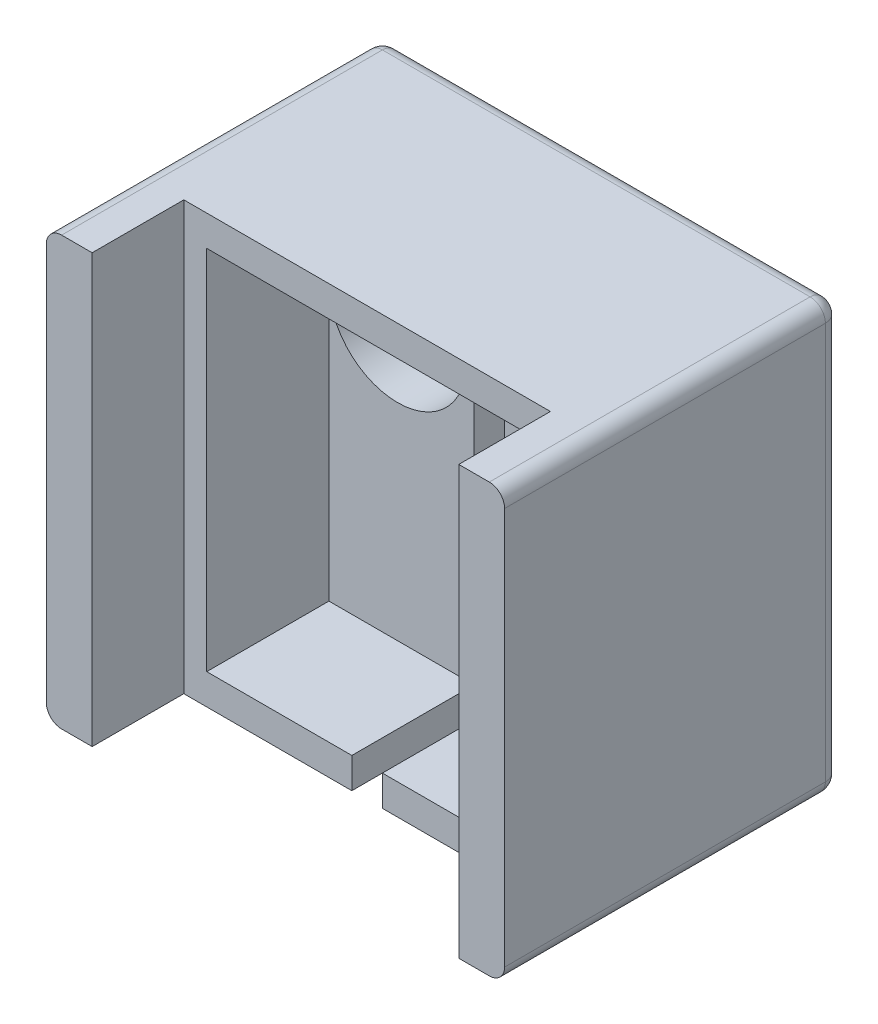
ISO-10303-21;
HEADER;
FILE_DESCRIPTION(('STEP AP214'),'2;1');
FILE_NAME('part.step','',(''),(''),'','','');
FILE_SCHEMA(('AUTOMOTIVE_DESIGN { 1 0 10303 214 1 1 1 1 }'));
ENDSEC;
DATA;
#1=APPLICATION_CONTEXT('core data for automotive mechanical design processes');
#2=APPLICATION_PROTOCOL_DEFINITION('international standard','automotive_design',2000,#1);
#3=PRODUCT_CONTEXT('',#1,'mechanical');
#4=PRODUCT('Part','Part','',(#3));
#5=PRODUCT_RELATED_PRODUCT_CATEGORY('part','',(#4));
#6=PRODUCT_DEFINITION_FORMATION('','',#4);
#7=PRODUCT_DEFINITION_CONTEXT('part definition',#1,'design');
#8=PRODUCT_DEFINITION('design','',#6,#7);
#9=PRODUCT_DEFINITION_SHAPE('','',#8);
#10=(LENGTH_UNIT() NAMED_UNIT(*) SI_UNIT(.MILLI.,.METRE.));
#11=(NAMED_UNIT(*) PLANE_ANGLE_UNIT() SI_UNIT($,.RADIAN.));
#12=(NAMED_UNIT(*) SI_UNIT($,.STERADIAN.) SOLID_ANGLE_UNIT());
#13=UNCERTAINTY_MEASURE_WITH_UNIT(LENGTH_MEASURE(1.E-05),#10,'distance_accuracy_value','');
#14=(GEOMETRIC_REPRESENTATION_CONTEXT(3) GLOBAL_UNCERTAINTY_ASSIGNED_CONTEXT((#13)) GLOBAL_UNIT_ASSIGNED_CONTEXT((#10,
#11,#12)) REPRESENTATION_CONTEXT('',''));
#15=CARTESIAN_POINT('',(0.,0.,0.));
#16=DIRECTION('',(0.,0.,1.));
#17=DIRECTION('',(1.,0.,0.));
#18=AXIS2_PLACEMENT_3D('',#15,#16,#17);
#19=CARTESIAN_POINT('',(2.25,0.999999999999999,4.));
#20=DIRECTION('',(0.,-1.,0.));
#21=DIRECTION('',(0.,0.,-1.));
#22=AXIS2_PLACEMENT_3D('',#19,#20,#21);
#23=PLANE('',#22);
#24=DIRECTION('',(1.,0.,0.));
#25=VECTOR('',#24,1.);
#26=CARTESIAN_POINT('',(2.25,0.999999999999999,8.));
#27=LINE('',#26,#25);
#28=CARTESIAN_POINT('',(2.25,0.999999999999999,8.));
#29=VERTEX_POINT('',#28);
#30=CARTESIAN_POINT('',(7.,1.,8.));
#31=VERTEX_POINT('',#30);
#32=EDGE_CURVE('E247',#29,#31,#27,.T.);
#33=ORIENTED_EDGE('',*,*,#32,.T.);
#34=DIRECTION('',(0.,0.,-1.));
#35=VECTOR('',#34,1.);
#36=CARTESIAN_POINT('',(7.,0.999999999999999,4.));
#37=LINE('',#36,#35);
#38=CARTESIAN_POINT('',(7.,0.999999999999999,4.));
#39=VERTEX_POINT('',#38);
#40=EDGE_CURVE('E241',#31,#39,#37,.T.);
#41=ORIENTED_EDGE('',*,*,#40,.T.);
#42=DIRECTION('',(1.,0.,0.));
#43=VECTOR('',#42,1.);
#44=CARTESIAN_POINT('',(2.25,0.999999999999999,4.));
#45=LINE('',#44,#43);
#46=CARTESIAN_POINT('',(2.25,0.999999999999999,4.));
#47=VERTEX_POINT('',#46);
#48=EDGE_CURVE('E260',#47,#39,#45,.T.);
#49=ORIENTED_EDGE('',*,*,#48,.F.);
#50=DIRECTION('',(0.,0.,1.));
#51=VECTOR('',#50,1.);
#52=CARTESIAN_POINT('',(2.25,0.999999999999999,4.));
#53=LINE('',#52,#51);
#54=EDGE_CURVE('E271',#47,#29,#53,.T.);
#55=ORIENTED_EDGE('',*,*,#54,.T.);
#56=EDGE_LOOP('',(#33,#41,#49,#55));
#57=FACE_BOUND('',#56,.T.);
#58=ADVANCED_FACE('F31',(#57),#23,.F.);
#59=CARTESIAN_POINT('',(2.25,0.999999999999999,4.));
#60=DIRECTION('',(0.,0.,1.));
#61=DIRECTION('',(1.,0.,0.));
#62=AXIS2_PLACEMENT_3D('',#59,#60,#61);
#63=PLANE('',#62);
#64=DIRECTION('',(0.,-1.,0.));
#65=VECTOR('',#64,1.);
#66=CARTESIAN_POINT('',(2.25,13.,4.));
#67=LINE('',#66,#65);
#68=CARTESIAN_POINT('',(2.25,13.,4.));
#69=VERTEX_POINT('',#68);
#70=CARTESIAN_POINT('',(2.25,10.,4.));
#71=VERTEX_POINT('',#70);
#72=EDGE_CURVE('E256',#69,#71,#67,.T.);
#73=ORIENTED_EDGE('',*,*,#72,.T.);
#74=CARTESIAN_POINT('',(4.5,10.,4.));
#75=DIRECTION('',(0.,0.,1.));
#76=DIRECTION('',(1.,0.,0.));
#77=AXIS2_PLACEMENT_3D('',#74,#75,#76);
#78=CIRCLE('',#77,2.25);
#79=EDGE_CURVE('E411',#71,#71,#78,.T.);
#80=ORIENTED_EDGE('',*,*,#79,.F.);
#81=EDGE_CURVE('E255',#71,#47,#67,.T.);
#82=ORIENTED_EDGE('',*,*,#81,.T.);
#83=ORIENTED_EDGE('',*,*,#48,.T.);
#84=DIRECTION('',(0.,-1.,0.));
#85=VECTOR('',#84,1.);
#86=CARTESIAN_POINT('',(7.,0.999999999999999,4.));
#87=LINE('',#86,#85);
#88=CARTESIAN_POINT('',(7.,13.,4.));
#89=VERTEX_POINT('',#88);
#90=EDGE_CURVE('E324',#89,#39,#87,.T.);
#91=ORIENTED_EDGE('',*,*,#90,.F.);
#92=DIRECTION('',(-1.,0.,0.));
#93=VECTOR('',#92,1.);
#94=CARTESIAN_POINT('',(2.25,13.,4.));
#95=LINE('',#94,#93);
#96=EDGE_CURVE('E267',#89,#69,#95,.T.);
#97=ORIENTED_EDGE('',*,*,#96,.T.);
#98=EDGE_LOOP('',(#73,#80,#82,#83,#91,#97));
#99=FACE_BOUND('',#98,.T.);
#100=ADVANCED_FACE('F451',(#99),#63,.T.);
#101=CARTESIAN_POINT('',(0.,14.,11.));
#102=DIRECTION('',(0.,0.,-1.));
#103=DIRECTION('',(-1.,0.,0.));
#104=AXIS2_PLACEMENT_3D('',#101,#102,#103);
#105=PLANE('',#104);
#106=DIRECTION('',(0.,-1.,0.));
#107=VECTOR('',#106,1.);
#108=CARTESIAN_POINT('',(0.,0.,11.));
#109=LINE('',#108,#107);
#110=CARTESIAN_POINT('',(0.,13.5,11.));
#111=VERTEX_POINT('',#110);
#112=CARTESIAN_POINT('',(0.,0.5,11.));
#113=VERTEX_POINT('',#112);
#114=EDGE_CURVE('E303',#111,#113,#109,.T.);
#115=ORIENTED_EDGE('',*,*,#114,.T.);
#116=CARTESIAN_POINT('',(0.5,0.5,11.));
#117=DIRECTION('',(0.,0.,-1.));
#118=DIRECTION('',(-1.,0.,0.));
#119=AXIS2_PLACEMENT_3D('',#116,#117,#118);
#120=CIRCLE('',#119,0.5);
#121=CARTESIAN_POINT('',(0.5,0.,11.));
#122=VERTEX_POINT('',#121);
#123=EDGE_CURVE('E351',#113,#122,#120,.F.);
#124=ORIENTED_EDGE('',*,*,#123,.T.);
#125=DIRECTION('',(1.,0.,0.));
#126=VECTOR('',#125,1.);
#127=CARTESIAN_POINT('',(0.,0.,11.));
#128=LINE('',#127,#126);
#129=CARTESIAN_POINT('',(1.5,0.,11.));
#130=VERTEX_POINT('',#129);
#131=EDGE_CURVE('E314',#122,#130,#128,.T.);
#132=ORIENTED_EDGE('',*,*,#131,.T.);
#133=DIRECTION('',(0.,-1.,0.));
#134=VECTOR('',#133,1.);
#135=CARTESIAN_POINT('',(1.5,14.,11.));
#136=LINE('',#135,#134);
#137=CARTESIAN_POINT('',(1.5,14.,11.));
#138=VERTEX_POINT('',#137);
#139=EDGE_CURVE('E275',#138,#130,#136,.T.);
#140=ORIENTED_EDGE('',*,*,#139,.F.);
#141=DIRECTION('',(-1.,0.,0.));
#142=VECTOR('',#141,1.);
#143=CARTESIAN_POINT('',(0.,14.,11.));
#144=LINE('',#143,#142);
#145=CARTESIAN_POINT('',(0.5,14.,11.));
#146=VERTEX_POINT('',#145);
#147=EDGE_CURVE('E319',#138,#146,#144,.T.);
#148=ORIENTED_EDGE('',*,*,#147,.T.);
#149=CARTESIAN_POINT('',(0.5,13.5,11.));
#150=DIRECTION('',(0.,0.,-1.));
#151=DIRECTION('',(-1.,0.,0.));
#152=AXIS2_PLACEMENT_3D('',#149,#150,#151);
#153=CIRCLE('',#152,0.5);
#154=EDGE_CURVE('E349',#146,#111,#153,.F.);
#155=ORIENTED_EDGE('',*,*,#154,.T.);
#156=EDGE_LOOP('',(#115,#124,#132,#140,#148,#155));
#157=FACE_BOUND('',#156,.T.);
#158=ADVANCED_FACE('F471',(#157),#105,.F.);
#159=CARTESIAN_POINT('',(0.,0.,11.));
#160=DIRECTION('',(1.,0.,0.));
#161=DIRECTION('',(0.,0.,-1.));
#162=AXIS2_PLACEMENT_3D('',#159,#160,#161);
#163=PLANE('',#162);
#164=DIRECTION('',(0.,-1.,0.));
#165=VECTOR('',#164,1.);
#166=CARTESIAN_POINT('',(0.,0.,0.5));
#167=LINE('',#166,#165);
#168=CARTESIAN_POINT('',(0.,13.5,0.5));
#169=VERTEX_POINT('',#168);
#170=CARTESIAN_POINT('',(0.,0.5,0.5));
#171=VERTEX_POINT('',#170);
#172=EDGE_CURVE('E343',#169,#171,#167,.T.);
#173=ORIENTED_EDGE('',*,*,#172,.T.);
#174=DIRECTION('',(0.,0.,-1.));
#175=VECTOR('',#174,1.);
#176=CARTESIAN_POINT('',(0.,0.5,11.));
#177=LINE('',#176,#175);
#178=EDGE_CURVE('E347',#171,#113,#177,.F.);
#179=ORIENTED_EDGE('',*,*,#178,.T.);
#180=ORIENTED_EDGE('',*,*,#114,.F.);
#181=DIRECTION('',(0.,0.,-1.));
#182=VECTOR('',#181,1.);
#183=CARTESIAN_POINT('',(0.,13.5,11.));
#184=LINE('',#183,#182);
#185=EDGE_CURVE('E345',#111,#169,#184,.T.);
#186=ORIENTED_EDGE('',*,*,#185,.T.);
#187=EDGE_LOOP('',(#173,#179,#180,#186));
#188=FACE_BOUND('',#187,.T.);
#189=ADVANCED_FACE('F33',(#188),#163,.F.);
#190=CARTESIAN_POINT('',(0.,0.,11.));
#191=DIRECTION('',(0.,1.,0.));
#192=DIRECTION('',(0.,0.,1.));
#193=AXIS2_PLACEMENT_3D('',#190,#191,#192);
#194=PLANE('',#193);
#195=DIRECTION('',(1.,0.,0.));
#196=VECTOR('',#195,1.);
#197=CARTESIAN_POINT('',(15.,0.,0.5));
#198=LINE('',#197,#196);
#199=CARTESIAN_POINT('',(0.5,0.,0.5));
#200=VERTEX_POINT('',#199);
#201=CARTESIAN_POINT('',(14.5,0.,0.5));
#202=VERTEX_POINT('',#201);
#203=EDGE_CURVE('E333',#200,#202,#198,.T.);
#204=ORIENTED_EDGE('',*,*,#203,.T.);
#205=DIRECTION('',(0.,0.,-1.));
#206=VECTOR('',#205,1.);
#207=CARTESIAN_POINT('',(14.5,0.,11.));
#208=LINE('',#207,#206);
#209=CARTESIAN_POINT('',(14.5,0.,11.));
#210=VERTEX_POINT('',#209);
#211=EDGE_CURVE('E337',#202,#210,#208,.F.);
#212=ORIENTED_EDGE('',*,*,#211,.T.);
#213=CARTESIAN_POINT('',(13.5,0.,11.));
#214=VERTEX_POINT('',#213);
#215=EDGE_CURVE('E313',#214,#210,#128,.T.);
#216=ORIENTED_EDGE('',*,*,#215,.F.);
#217=DIRECTION('',(0.,0.,1.));
#218=VECTOR('',#217,1.);
#219=CARTESIAN_POINT('',(13.5,0.,8.));
#220=LINE('',#219,#218);
#221=CARTESIAN_POINT('',(13.5,0.,8.));
#222=VERTEX_POINT('',#221);
#223=EDGE_CURVE('E307',#222,#214,#220,.T.);
#224=ORIENTED_EDGE('',*,*,#223,.F.);
#225=DIRECTION('',(1.,0.,0.));
#226=VECTOR('',#225,1.);
#227=CARTESIAN_POINT('',(1.5,0.,8.));
#228=LINE('',#227,#226);
#229=CARTESIAN_POINT('',(8.,0.,8.));
#230=VERTEX_POINT('',#229);
#231=EDGE_CURVE('E222',#230,#222,#228,.T.);
#232=ORIENTED_EDGE('',*,*,#231,.F.);
#233=DIRECTION('',(0.,0.,1.));
#234=VECTOR('',#233,1.);
#235=CARTESIAN_POINT('',(8.,0.,8.));
#236=LINE('',#235,#234);
#237=CARTESIAN_POINT('',(8.,0.,3.));
#238=VERTEX_POINT('',#237);
#239=EDGE_CURVE('E199',#238,#230,#236,.T.);
#240=ORIENTED_EDGE('',*,*,#239,.F.);
#241=DIRECTION('',(1.,0.,0.));
#242=VECTOR('',#241,1.);
#243=CARTESIAN_POINT('',(8.,0.,3.));
#244=LINE('',#243,#242);
#245=CARTESIAN_POINT('',(7.,0.,3.));
#246=VERTEX_POINT('',#245);
#247=EDGE_CURVE('E209',#246,#238,#244,.T.);
#248=ORIENTED_EDGE('',*,*,#247,.F.);
#249=DIRECTION('',(0.,0.,-1.));
#250=VECTOR('',#249,1.);
#251=CARTESIAN_POINT('',(7.,0.,8.));
#252=LINE('',#251,#250);
#253=CARTESIAN_POINT('',(7.,0.,8.));
#254=VERTEX_POINT('',#253);
#255=EDGE_CURVE('E217',#254,#246,#252,.T.);
#256=ORIENTED_EDGE('',*,*,#255,.F.);
#257=CARTESIAN_POINT('',(1.5,0.,8.));
#258=VERTEX_POINT('',#257);
#259=EDGE_CURVE('E291',#258,#254,#228,.T.);
#260=ORIENTED_EDGE('',*,*,#259,.F.);
#261=DIRECTION('',(0.,0.,1.));
#262=VECTOR('',#261,1.);
#263=CARTESIAN_POINT('',(1.5,0.,8.));
#264=LINE('',#263,#262);
#265=EDGE_CURVE('E300',#258,#130,#264,.T.);
#266=ORIENTED_EDGE('',*,*,#265,.T.);
#267=ORIENTED_EDGE('',*,*,#131,.F.);
#268=DIRECTION('',(0.,0.,-1.));
#269=VECTOR('',#268,1.);
#270=CARTESIAN_POINT('',(0.5,0.,11.));
#271=LINE('',#270,#269);
#272=EDGE_CURVE('E335',#122,#200,#271,.T.);
#273=ORIENTED_EDGE('',*,*,#272,.T.);
#274=EDGE_LOOP('',(#204,#212,#216,#224,#232,#240,#248,#256,#260,#266,#267,#273));
#275=FACE_BOUND('',#274,.T.);
#276=ADVANCED_FACE('F220',(#275),#194,.F.);
#277=CARTESIAN_POINT('',(15.,0.,11.));
#278=DIRECTION('',(-1.,0.,0.));
#279=DIRECTION('',(0.,0.,1.));
#280=AXIS2_PLACEMENT_3D('',#277,#278,#279);
#281=PLANE('',#280);
#282=DIRECTION('',(0.,1.,0.));
#283=VECTOR('',#282,1.);
#284=CARTESIAN_POINT('',(15.,0.,11.));
#285=LINE('',#284,#283);
#286=CARTESIAN_POINT('',(15.,0.5,11.));
#287=VERTEX_POINT('',#286);
#288=CARTESIAN_POINT('',(15.,13.5,11.));
#289=VERTEX_POINT('',#288);
#290=EDGE_CURVE('E316',#287,#289,#285,.T.);
#291=ORIENTED_EDGE('',*,*,#290,.F.);
#292=DIRECTION('',(0.,0.,-1.));
#293=VECTOR('',#292,1.);
#294=CARTESIAN_POINT('',(15.,0.5,11.));
#295=LINE('',#294,#293);
#296=CARTESIAN_POINT('',(15.,0.5,0.5));
#297=VERTEX_POINT('',#296);
#298=EDGE_CURVE('E330',#287,#297,#295,.T.);
#299=ORIENTED_EDGE('',*,*,#298,.T.);
#300=DIRECTION('',(0.,1.,0.));
#301=VECTOR('',#300,1.);
#302=CARTESIAN_POINT('',(15.,14.,0.5));
#303=LINE('',#302,#301);
#304=CARTESIAN_POINT('',(15.,13.5,0.5));
#305=VERTEX_POINT('',#304);
#306=EDGE_CURVE('E326',#297,#305,#303,.T.);
#307=ORIENTED_EDGE('',*,*,#306,.T.);
#308=DIRECTION('',(0.,0.,-1.));
#309=VECTOR('',#308,1.);
#310=CARTESIAN_POINT('',(15.,13.5,11.));
#311=LINE('',#310,#309);
#312=EDGE_CURVE('E328',#305,#289,#311,.F.);
#313=ORIENTED_EDGE('',*,*,#312,.T.);
#314=EDGE_LOOP('',(#291,#299,#307,#313));
#315=FACE_BOUND('',#314,.T.);
#316=ADVANCED_FACE('F496',(#315),#281,.F.);
#317=CARTESIAN_POINT('',(0.,14.,11.));
#318=DIRECTION('',(0.,-1.,0.));
#319=DIRECTION('',(0.,0.,-1.));
#320=AXIS2_PLACEMENT_3D('',#317,#318,#319);
#321=PLANE('',#320);
#322=DIRECTION('',(-1.,0.,0.));
#323=VECTOR('',#322,1.);
#324=CARTESIAN_POINT('',(0.,14.,0.5));
#325=LINE('',#324,#323);
#326=CARTESIAN_POINT('',(14.5,14.,0.5));
#327=VERTEX_POINT('',#326);
#328=CARTESIAN_POINT('',(0.5,14.,0.5));
#329=VERTEX_POINT('',#328);
#330=EDGE_CURVE('E353',#327,#329,#325,.T.);
#331=ORIENTED_EDGE('',*,*,#330,.T.);
#332=DIRECTION('',(0.,0.,-1.));
#333=VECTOR('',#332,1.);
#334=CARTESIAN_POINT('',(0.5,14.,11.));
#335=LINE('',#334,#333);
#336=EDGE_CURVE('E357',#329,#146,#335,.F.);
#337=ORIENTED_EDGE('',*,*,#336,.T.);
#338=ORIENTED_EDGE('',*,*,#147,.F.);
#339=DIRECTION('',(0.,0.,1.));
#340=VECTOR('',#339,1.);
#341=CARTESIAN_POINT('',(1.5,14.,8.));
#342=LINE('',#341,#340);
#343=CARTESIAN_POINT('',(1.5,14.,8.));
#344=VERTEX_POINT('',#343);
#345=EDGE_CURVE('E301',#344,#138,#342,.T.);
#346=ORIENTED_EDGE('',*,*,#345,.F.);
#347=DIRECTION('',(-1.,0.,0.));
#348=VECTOR('',#347,1.);
#349=CARTESIAN_POINT('',(1.5,14.,8.));
#350=LINE('',#349,#348);
#351=CARTESIAN_POINT('',(13.5,14.,8.));
#352=VERTEX_POINT('',#351);
#353=EDGE_CURVE('E297',#352,#344,#350,.T.);
#354=ORIENTED_EDGE('',*,*,#353,.F.);
#355=DIRECTION('',(0.,0.,1.));
#356=VECTOR('',#355,1.);
#357=CARTESIAN_POINT('',(13.5,14.,8.));
#358=LINE('',#357,#356);
#359=CARTESIAN_POINT('',(13.5,14.,11.));
#360=VERTEX_POINT('',#359);
#361=EDGE_CURVE('E304',#352,#360,#358,.T.);
#362=ORIENTED_EDGE('',*,*,#361,.T.);
#363=CARTESIAN_POINT('',(14.5,14.,11.));
#364=VERTEX_POINT('',#363);
#365=EDGE_CURVE('E320',#364,#360,#144,.T.);
#366=ORIENTED_EDGE('',*,*,#365,.F.);
#367=DIRECTION('',(0.,0.,-1.));
#368=VECTOR('',#367,1.);
#369=CARTESIAN_POINT('',(14.5,14.,11.));
#370=LINE('',#369,#368);
#371=EDGE_CURVE('E355',#364,#327,#370,.T.);
#372=ORIENTED_EDGE('',*,*,#371,.T.);
#373=EDGE_LOOP('',(#331,#337,#338,#346,#354,#362,#366,#372));
#374=FACE_BOUND('',#373,.T.);
#375=ADVANCED_FACE('F729',(#374),#321,.F.);
#376=ORIENTED_EDGE('',*,*,#215,.T.);
#377=CARTESIAN_POINT('',(14.5,0.5,11.));
#378=DIRECTION('',(0.,0.,-1.));
#379=DIRECTION('',(-1.,0.,0.));
#380=AXIS2_PLACEMENT_3D('',#377,#378,#379);
#381=CIRCLE('',#380,0.5);
#382=EDGE_CURVE('E341',#210,#287,#381,.F.);
#383=ORIENTED_EDGE('',*,*,#382,.T.);
#384=ORIENTED_EDGE('',*,*,#290,.T.);
#385=CARTESIAN_POINT('',(14.5,13.5,11.));
#386=DIRECTION('',(0.,0.,-1.));
#387=DIRECTION('',(-1.,0.,0.));
#388=AXIS2_PLACEMENT_3D('',#385,#386,#387);
#389=CIRCLE('',#388,0.5);
#390=EDGE_CURVE('E339',#289,#364,#389,.F.);
#391=ORIENTED_EDGE('',*,*,#390,.T.);
#392=ORIENTED_EDGE('',*,*,#365,.T.);
#393=DIRECTION('',(0.,1.,0.));
#394=VECTOR('',#393,1.);
#395=CARTESIAN_POINT('',(13.5,14.,11.));
#396=LINE('',#395,#394);
#397=EDGE_CURVE('E285',#214,#360,#396,.T.);
#398=ORIENTED_EDGE('',*,*,#397,.F.);
#399=EDGE_LOOP('',(#376,#383,#384,#391,#392,#398));
#400=FACE_BOUND('',#399,.T.);
#401=ADVANCED_FACE('F705',(#400),#105,.F.);
#402=CARTESIAN_POINT('',(0.,14.,0.));
#403=DIRECTION('',(0.,0.,-1.));
#404=DIRECTION('',(-1.,0.,0.));
#405=AXIS2_PLACEMENT_3D('',#402,#403,#404);
#406=PLANE('',#405);
#407=DIRECTION('',(0.,-1.,0.));
#408=VECTOR('',#407,1.);
#409=CARTESIAN_POINT('',(0.5,14.,0.));
#410=LINE('',#409,#408);
#411=CARTESIAN_POINT('',(0.5,0.5,0.));
#412=VERTEX_POINT('',#411);
#413=CARTESIAN_POINT('',(0.5,13.5,0.));
#414=VERTEX_POINT('',#413);
#415=EDGE_CURVE('E359',#412,#414,#410,.F.);
#416=ORIENTED_EDGE('',*,*,#415,.T.);
#417=DIRECTION('',(-1.,0.,0.));
#418=VECTOR('',#417,1.);
#419=CARTESIAN_POINT('',(15.,13.5,0.));
#420=LINE('',#419,#418);
#421=CARTESIAN_POINT('',(14.5,13.5,0.));
#422=VERTEX_POINT('',#421);
#423=EDGE_CURVE('E11',#414,#422,#420,.F.);
#424=ORIENTED_EDGE('',*,*,#423,.T.);
#425=DIRECTION('',(0.,1.,0.));
#426=VECTOR('',#425,1.);
#427=CARTESIAN_POINT('',(14.5,0.,0.));
#428=LINE('',#427,#426);
#429=CARTESIAN_POINT('',(14.5,0.5,0.));
#430=VERTEX_POINT('',#429);
#431=EDGE_CURVE('E39',#422,#430,#428,.F.);
#432=ORIENTED_EDGE('',*,*,#431,.T.);
#433=DIRECTION('',(1.,0.,0.));
#434=VECTOR('',#433,1.);
#435=CARTESIAN_POINT('',(0.,0.5,0.));
#436=LINE('',#435,#434);
#437=EDGE_CURVE('E361',#430,#412,#436,.F.);
#438=ORIENTED_EDGE('',*,*,#437,.T.);
#439=EDGE_LOOP('',(#416,#424,#432,#438));
#440=FACE_BOUND('',#439,.T.);
#441=CARTESIAN_POINT('',(4.5,10.,0.));
#442=DIRECTION('',(0.,0.,1.));
#443=DIRECTION('',(1.,0.,0.));
#444=AXIS2_PLACEMENT_3D('',#441,#442,#443);
#445=CIRCLE('',#444,2.25);
#446=CARTESIAN_POINT('',(6.75,10.,0.));
#447=VERTEX_POINT('',#446);
#448=EDGE_CURVE('E413',#447,#447,#445,.T.);
#449=ORIENTED_EDGE('',*,*,#448,.T.);
#450=EDGE_LOOP('',(#449));
#451=FACE_BOUND('',#450,.T.);
#452=CARTESIAN_POINT('',(10.5,5.,0.));
#453=DIRECTION('',(0.,0.,1.));
#454=DIRECTION('',(1.,0.,0.));
#455=AXIS2_PLACEMENT_3D('',#452,#453,#454);
#456=CIRCLE('',#455,2.25);
#457=CARTESIAN_POINT('',(12.75,5.,0.));
#458=VERTEX_POINT('',#457);
#459=EDGE_CURVE('E223',#458,#458,#456,.T.);
#460=ORIENTED_EDGE('',*,*,#459,.T.);
#461=EDGE_LOOP('',(#460));
#462=FACE_BOUND('',#461,.T.);
#463=ADVANCED_FACE('F363',(#440,#451,#462),#406,.T.);
#464=CARTESIAN_POINT('',(1.5,14.,8.));
#465=DIRECTION('',(-1.,0.,0.));
#466=DIRECTION('',(0.,0.,1.));
#467=AXIS2_PLACEMENT_3D('',#464,#465,#466);
#468=PLANE('',#467);
#469=ORIENTED_EDGE('',*,*,#139,.T.);
#470=ORIENTED_EDGE('',*,*,#265,.F.);
#471=DIRECTION('',(0.,-1.,0.));
#472=VECTOR('',#471,1.);
#473=CARTESIAN_POINT('',(1.5,14.,8.));
#474=LINE('',#473,#472);
#475=EDGE_CURVE('E288',#344,#258,#474,.T.);
#476=ORIENTED_EDGE('',*,*,#475,.F.);
#477=ORIENTED_EDGE('',*,*,#345,.T.);
#478=EDGE_LOOP('',(#469,#470,#476,#477));
#479=FACE_BOUND('',#478,.T.);
#480=ADVANCED_FACE('F459',(#479),#468,.F.);
#481=CARTESIAN_POINT('',(13.5,14.,8.));
#482=DIRECTION('',(1.,0.,0.));
#483=DIRECTION('',(0.,0.,-1.));
#484=AXIS2_PLACEMENT_3D('',#481,#482,#483);
#485=PLANE('',#484);
#486=ORIENTED_EDGE('',*,*,#397,.T.);
#487=ORIENTED_EDGE('',*,*,#361,.F.);
#488=DIRECTION('',(0.,1.,0.));
#489=VECTOR('',#488,1.);
#490=CARTESIAN_POINT('',(13.5,14.,8.));
#491=LINE('',#490,#489);
#492=EDGE_CURVE('E294',#222,#352,#491,.T.);
#493=ORIENTED_EDGE('',*,*,#492,.F.);
#494=ORIENTED_EDGE('',*,*,#223,.T.);
#495=EDGE_LOOP('',(#486,#487,#493,#494));
#496=FACE_BOUND('',#495,.T.);
#497=ADVANCED_FACE('F761',(#496),#485,.F.);
#498=CARTESIAN_POINT('',(1.5,0.,8.));
#499=DIRECTION('',(0.,0.,1.));
#500=DIRECTION('',(1.,0.,0.));
#501=AXIS2_PLACEMENT_3D('',#498,#499,#500);
#502=PLANE('',#501);
#503=DIRECTION('',(0.,-1.,0.));
#504=VECTOR('',#503,1.);
#505=CARTESIAN_POINT('',(7.,18.0990195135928,8.));
#506=LINE('',#505,#504);
#507=EDGE_CURVE('E216',#31,#254,#506,.T.);
#508=ORIENTED_EDGE('',*,*,#507,.F.);
#509=ORIENTED_EDGE('',*,*,#32,.F.);
#510=DIRECTION('',(0.,-1.,0.));
#511=VECTOR('',#510,1.);
#512=CARTESIAN_POINT('',(2.25,13.,8.));
#513=LINE('',#512,#511);
#514=CARTESIAN_POINT('',(2.25,13.,8.));
#515=VERTEX_POINT('',#514);
#516=EDGE_CURVE('E244',#515,#29,#513,.T.);
#517=ORIENTED_EDGE('',*,*,#516,.F.);
#518=DIRECTION('',(-1.,0.,0.));
#519=VECTOR('',#518,1.);
#520=CARTESIAN_POINT('',(2.25,13.,8.));
#521=LINE('',#520,#519);
#522=CARTESIAN_POINT('',(12.75,13.,8.));
#523=VERTEX_POINT('',#522);
#524=EDGE_CURVE('E253',#523,#515,#521,.T.);
#525=ORIENTED_EDGE('',*,*,#524,.F.);
#526=DIRECTION('',(0.,1.,0.));
#527=VECTOR('',#526,1.);
#528=CARTESIAN_POINT('',(12.75,13.,8.));
#529=LINE('',#528,#527);
#530=CARTESIAN_POINT('',(12.75,0.999999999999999,8.));
#531=VERTEX_POINT('',#530);
#532=EDGE_CURVE('E250',#531,#523,#529,.T.);
#533=ORIENTED_EDGE('',*,*,#532,.F.);
#534=CARTESIAN_POINT('',(8.,1.,8.));
#535=VERTEX_POINT('',#534);
#536=EDGE_CURVE('E246',#535,#531,#27,.T.);
#537=ORIENTED_EDGE('',*,*,#536,.F.);
#538=DIRECTION('',(0.,-1.,0.));
#539=VECTOR('',#538,1.);
#540=CARTESIAN_POINT('',(8.,18.0990195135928,8.));
#541=LINE('',#540,#539);
#542=EDGE_CURVE('E231',#535,#230,#541,.T.);
#543=ORIENTED_EDGE('',*,*,#542,.T.);
#544=ORIENTED_EDGE('',*,*,#231,.T.);
#545=ORIENTED_EDGE('',*,*,#492,.T.);
#546=ORIENTED_EDGE('',*,*,#353,.T.);
#547=ORIENTED_EDGE('',*,*,#475,.T.);
#548=ORIENTED_EDGE('',*,*,#259,.T.);
#549=EDGE_LOOP('',(#508,#509,#517,#525,#533,#537,#543,#544,#545,#546,#547,#548));
#550=FACE_BOUND('',#549,.T.);
#551=ADVANCED_FACE('F439',(#550),#502,.T.);
#552=CARTESIAN_POINT('',(2.25,13.,4.));
#553=DIRECTION('',(-1.,0.,0.));
#554=DIRECTION('',(0.,0.,1.));
#555=AXIS2_PLACEMENT_3D('',#552,#553,#554);
#556=PLANE('',#555);
#557=ORIENTED_EDGE('',*,*,#516,.T.);
#558=ORIENTED_EDGE('',*,*,#54,.F.);
#559=ORIENTED_EDGE('',*,*,#81,.F.);
#560=ORIENTED_EDGE('',*,*,#72,.F.);
#561=DIRECTION('',(0.,0.,1.));
#562=VECTOR('',#561,1.);
#563=CARTESIAN_POINT('',(2.25,13.,4.));
#564=LINE('',#563,#562);
#565=EDGE_CURVE('E272',#69,#515,#564,.T.);
#566=ORIENTED_EDGE('',*,*,#565,.T.);
#567=EDGE_LOOP('',(#557,#558,#559,#560,#566));
#568=FACE_BOUND('',#567,.T.);
#569=ADVANCED_FACE('F446',(#568),#556,.F.);
#570=CARTESIAN_POINT('',(2.25,13.,4.));
#571=DIRECTION('',(0.,1.,0.));
#572=DIRECTION('',(0.,0.,1.));
#573=AXIS2_PLACEMENT_3D('',#570,#571,#572);
#574=PLANE('',#573);
#575=ORIENTED_EDGE('',*,*,#524,.T.);
#576=ORIENTED_EDGE('',*,*,#565,.F.);
#577=ORIENTED_EDGE('',*,*,#96,.F.);
#578=DIRECTION('',(0.,0.,-1.));
#579=VECTOR('',#578,1.);
#580=CARTESIAN_POINT('',(7.,13.,8.));
#581=LINE('',#580,#579);
#582=CARTESIAN_POINT('',(7.,13.,3.));
#583=VERTEX_POINT('',#582);
#584=EDGE_CURVE('E233',#89,#583,#581,.T.);
#585=ORIENTED_EDGE('',*,*,#584,.T.);
#586=DIRECTION('',(1.,0.,0.));
#587=VECTOR('',#586,1.);
#588=CARTESIAN_POINT('',(8.,13.,3.));
#589=LINE('',#588,#587);
#590=CARTESIAN_POINT('',(8.,13.,3.));
#591=VERTEX_POINT('',#590);
#592=EDGE_CURVE('E206',#583,#591,#589,.T.);
#593=ORIENTED_EDGE('',*,*,#592,.T.);
#594=DIRECTION('',(0.,0.,1.));
#595=VECTOR('',#594,1.);
#596=CARTESIAN_POINT('',(8.,13.,8.));
#597=LINE('',#596,#595);
#598=CARTESIAN_POINT('',(8.,13.,4.));
#599=VERTEX_POINT('',#598);
#600=EDGE_CURVE('E202',#591,#599,#597,.T.);
#601=ORIENTED_EDGE('',*,*,#600,.T.);
#602=CARTESIAN_POINT('',(12.75,13.,4.));
#603=VERTEX_POINT('',#602);
#604=EDGE_CURVE('E268',#603,#599,#95,.T.);
#605=ORIENTED_EDGE('',*,*,#604,.F.);
#606=DIRECTION('',(0.,0.,1.));
#607=VECTOR('',#606,1.);
#608=CARTESIAN_POINT('',(12.75,13.,4.));
#609=LINE('',#608,#607);
#610=EDGE_CURVE('E276',#603,#523,#609,.T.);
#611=ORIENTED_EDGE('',*,*,#610,.T.);
#612=EDGE_LOOP('',(#575,#576,#577,#585,#593,#601,#605,#611));
#613=FACE_BOUND('',#612,.T.);
#614=ADVANCED_FACE('F430',(#613),#574,.F.);
#615=CARTESIAN_POINT('',(12.75,13.,4.));
#616=DIRECTION('',(1.,0.,0.));
#617=DIRECTION('',(0.,0.,-1.));
#618=AXIS2_PLACEMENT_3D('',#615,#616,#617);
#619=PLANE('',#618);
#620=ORIENTED_EDGE('',*,*,#532,.T.);
#621=ORIENTED_EDGE('',*,*,#610,.F.);
#622=DIRECTION('',(0.,1.,0.));
#623=VECTOR('',#622,1.);
#624=CARTESIAN_POINT('',(12.75,13.,4.));
#625=LINE('',#624,#623);
#626=CARTESIAN_POINT('',(12.75,5.,4.));
#627=VERTEX_POINT('',#626);
#628=EDGE_CURVE('E263',#627,#603,#625,.T.);
#629=ORIENTED_EDGE('',*,*,#628,.F.);
#630=CARTESIAN_POINT('',(12.75,0.999999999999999,4.));
#631=VERTEX_POINT('',#630);
#632=EDGE_CURVE('E264',#631,#627,#625,.T.);
#633=ORIENTED_EDGE('',*,*,#632,.F.);
#634=DIRECTION('',(0.,0.,1.));
#635=VECTOR('',#634,1.);
#636=CARTESIAN_POINT('',(12.75,0.999999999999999,4.));
#637=LINE('',#636,#635);
#638=EDGE_CURVE('E278',#631,#531,#637,.T.);
#639=ORIENTED_EDGE('',*,*,#638,.T.);
#640=EDGE_LOOP('',(#620,#621,#629,#633,#639));
#641=FACE_BOUND('',#640,.T.);
#642=ADVANCED_FACE('F425',(#641),#619,.F.);
#643=CARTESIAN_POINT('',(8.,0.999999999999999,4.));
#644=VERTEX_POINT('',#643);
#645=EDGE_CURVE('E259',#644,#631,#45,.T.);
#646=ORIENTED_EDGE('',*,*,#645,.F.);
#647=DIRECTION('',(0.,0.,1.));
#648=VECTOR('',#647,1.);
#649=CARTESIAN_POINT('',(8.,0.999999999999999,4.));
#650=LINE('',#649,#648);
#651=EDGE_CURVE('E238',#644,#535,#650,.T.);
#652=ORIENTED_EDGE('',*,*,#651,.T.);
#653=ORIENTED_EDGE('',*,*,#536,.T.);
#654=ORIENTED_EDGE('',*,*,#638,.F.);
#655=EDGE_LOOP('',(#646,#652,#653,#654));
#656=FACE_BOUND('',#655,.T.);
#657=ADVANCED_FACE('F435',(#656),#23,.F.);
#658=ORIENTED_EDGE('',*,*,#632,.T.);
#659=CARTESIAN_POINT('',(10.5,5.,4.));
#660=DIRECTION('',(0.,0.,1.));
#661=DIRECTION('',(1.,0.,0.));
#662=AXIS2_PLACEMENT_3D('',#659,#660,#661);
#663=CIRCLE('',#662,2.25);
#664=EDGE_CURVE('E227',#627,#627,#663,.T.);
#665=ORIENTED_EDGE('',*,*,#664,.F.);
#666=ORIENTED_EDGE('',*,*,#628,.T.);
#667=ORIENTED_EDGE('',*,*,#604,.T.);
#668=DIRECTION('',(0.,1.,0.));
#669=VECTOR('',#668,1.);
#670=CARTESIAN_POINT('',(8.,0.999999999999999,4.));
#671=LINE('',#670,#669);
#672=EDGE_CURVE('E322',#644,#599,#671,.T.);
#673=ORIENTED_EDGE('',*,*,#672,.F.);
#674=ORIENTED_EDGE('',*,*,#645,.T.);
#675=EDGE_LOOP('',(#658,#665,#666,#667,#673,#674));
#676=FACE_BOUND('',#675,.T.);
#677=ADVANCED_FACE('F421',(#676),#63,.T.);
#678=CARTESIAN_POINT('',(7.,18.0990195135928,8.));
#679=DIRECTION('',(-1.,0.,0.));
#680=DIRECTION('',(0.,0.,1.));
#681=AXIS2_PLACEMENT_3D('',#678,#679,#680);
#682=PLANE('',#681);
#683=ORIENTED_EDGE('',*,*,#507,.T.);
#684=ORIENTED_EDGE('',*,*,#255,.T.);
#685=DIRECTION('',(0.,-1.,0.));
#686=VECTOR('',#685,1.);
#687=CARTESIAN_POINT('',(7.,18.0990195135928,3.));
#688=LINE('',#687,#686);
#689=EDGE_CURVE('E212',#583,#246,#688,.T.);
#690=ORIENTED_EDGE('',*,*,#689,.F.);
#691=ORIENTED_EDGE('',*,*,#584,.F.);
#692=ORIENTED_EDGE('',*,*,#90,.T.);
#693=ORIENTED_EDGE('',*,*,#40,.F.);
#694=EDGE_LOOP('',(#683,#684,#690,#691,#692,#693));
#695=FACE_BOUND('',#694,.T.);
#696=ADVANCED_FACE('F454',(#695),#682,.F.);
#697=CARTESIAN_POINT('',(8.,18.0990195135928,8.));
#698=DIRECTION('',(1.,0.,0.));
#699=DIRECTION('',(0.,0.,-1.));
#700=AXIS2_PLACEMENT_3D('',#697,#698,#699);
#701=PLANE('',#700);
#702=ORIENTED_EDGE('',*,*,#672,.T.);
#703=ORIENTED_EDGE('',*,*,#600,.F.);
#704=DIRECTION('',(0.,-1.,0.));
#705=VECTOR('',#704,1.);
#706=CARTESIAN_POINT('',(8.,18.0990195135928,3.));
#707=LINE('',#706,#705);
#708=EDGE_CURVE('E195',#591,#238,#707,.T.);
#709=ORIENTED_EDGE('',*,*,#708,.T.);
#710=ORIENTED_EDGE('',*,*,#239,.T.);
#711=ORIENTED_EDGE('',*,*,#542,.F.);
#712=ORIENTED_EDGE('',*,*,#651,.F.);
#713=EDGE_LOOP('',(#702,#703,#709,#710,#711,#712));
#714=FACE_BOUND('',#713,.T.);
#715=ADVANCED_FACE('F197',(#714),#701,.F.);
#716=CARTESIAN_POINT('',(8.,18.0990195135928,3.));
#717=DIRECTION('',(0.,0.,-1.));
#718=DIRECTION('',(-1.,0.,0.));
#719=AXIS2_PLACEMENT_3D('',#716,#717,#718);
#720=PLANE('',#719);
#721=ORIENTED_EDGE('',*,*,#689,.T.);
#722=ORIENTED_EDGE('',*,*,#247,.T.);
#723=ORIENTED_EDGE('',*,*,#708,.F.);
#724=ORIENTED_EDGE('',*,*,#592,.F.);
#725=EDGE_LOOP('',(#721,#722,#723,#724));
#726=FACE_BOUND('',#725,.T.);
#727=ADVANCED_FACE('F210',(#726),#720,.F.);
#728=CARTESIAN_POINT('',(10.5,5.,0.));
#729=DIRECTION('',(0.,0.,1.));
#730=DIRECTION('',(1.,0.,0.));
#731=AXIS2_PLACEMENT_3D('',#728,#729,#730);
#732=CYLINDRICAL_SURFACE('',#731,2.25);
#733=ORIENTED_EDGE('',*,*,#459,.F.);
#734=EDGE_LOOP('',(#733));
#735=FACE_BOUND('',#734,.T.);
#736=ORIENTED_EDGE('',*,*,#664,.T.);
#737=EDGE_LOOP('',(#736));
#738=FACE_BOUND('',#737,.T.);
#739=ADVANCED_FACE('F418',(#735,#738),#732,.F.);
#740=CARTESIAN_POINT('',(4.5,10.,0.));
#741=DIRECTION('',(0.,0.,1.));
#742=DIRECTION('',(1.,0.,0.));
#743=AXIS2_PLACEMENT_3D('',#740,#741,#742);
#744=CYLINDRICAL_SURFACE('',#743,2.25);
#745=ORIENTED_EDGE('',*,*,#448,.F.);
#746=EDGE_LOOP('',(#745));
#747=FACE_BOUND('',#746,.T.);
#748=ORIENTED_EDGE('',*,*,#79,.T.);
#749=EDGE_LOOP('',(#748));
#750=FACE_BOUND('',#749,.T.);
#751=ADVANCED_FACE('F541',(#747,#750),#744,.F.);
#752=CARTESIAN_POINT('',(0.5,13.5,11.));
#753=DIRECTION('',(0.,0.,-1.));
#754=DIRECTION('',(-1.,0.,0.));
#755=AXIS2_PLACEMENT_3D('',#752,#753,#754);
#756=CYLINDRICAL_SURFACE('',#755,0.5);
#757=CARTESIAN_POINT('',(0.5,13.5,0.5));
#758=DIRECTION('',(0.,0.,-1.));
#759=DIRECTION('',(-1.,0.,0.));
#760=AXIS2_PLACEMENT_3D('',#757,#758,#759);
#761=CIRCLE('',#760,0.5);
#762=EDGE_CURVE('E408',#169,#329,#761,.T.);
#763=ORIENTED_EDGE('',*,*,#762,.F.);
#764=ORIENTED_EDGE('',*,*,#185,.F.);
#765=ORIENTED_EDGE('',*,*,#154,.F.);
#766=ORIENTED_EDGE('',*,*,#336,.F.);
#767=EDGE_LOOP('',(#763,#764,#765,#766));
#768=FACE_BOUND('',#767,.T.);
#769=ADVANCED_FACE('F478',(#768),#756,.T.);
#770=CARTESIAN_POINT('',(0.5,13.5,0.5));
#771=DIRECTION('',(0.,0.,1.));
#772=DIRECTION('',(1.,0.,0.));
#773=AXIS2_PLACEMENT_3D('',#770,#771,#772);
#774=SPHERICAL_SURFACE('',#773,0.5);
#775=CARTESIAN_POINT('',(0.5,13.5,0.5));
#776=DIRECTION('',(0.,1.,0.));
#777=DIRECTION('',(0.,0.,1.));
#778=AXIS2_PLACEMENT_3D('',#775,#776,#777);
#779=CIRCLE('',#778,0.5);
#780=EDGE_CURVE('E377',#169,#414,#779,.F.);
#781=ORIENTED_EDGE('',*,*,#780,.F.);
#782=ORIENTED_EDGE('',*,*,#762,.T.);
#783=CARTESIAN_POINT('',(0.5,13.5,0.5));
#784=DIRECTION('',(-1.,0.,0.));
#785=DIRECTION('',(0.,0.,1.));
#786=AXIS2_PLACEMENT_3D('',#783,#784,#785);
#787=CIRCLE('',#786,0.5);
#788=EDGE_CURVE('E405',#414,#329,#787,.F.);
#789=ORIENTED_EDGE('',*,*,#788,.F.);
#790=EDGE_LOOP('',(#781,#782,#789));
#791=FACE_BOUND('',#790,.T.);
#792=ADVANCED_FACE('F480',(#791),#774,.T.);
#793=CARTESIAN_POINT('',(14.5,13.5,11.));
#794=DIRECTION('',(0.,0.,-1.));
#795=DIRECTION('',(-1.,0.,0.));
#796=AXIS2_PLACEMENT_3D('',#793,#794,#795);
#797=CYLINDRICAL_SURFACE('',#796,0.5);
#798=ORIENTED_EDGE('',*,*,#390,.F.);
#799=ORIENTED_EDGE('',*,*,#312,.F.);
#800=CARTESIAN_POINT('',(14.5,13.5,0.5));
#801=DIRECTION('',(0.,0.,-1.));
#802=DIRECTION('',(-1.,0.,0.));
#803=AXIS2_PLACEMENT_3D('',#800,#801,#802);
#804=CIRCLE('',#803,0.5);
#805=EDGE_CURVE('E401',#327,#305,#804,.T.);
#806=ORIENTED_EDGE('',*,*,#805,.F.);
#807=ORIENTED_EDGE('',*,*,#371,.F.);
#808=EDGE_LOOP('',(#798,#799,#806,#807));
#809=FACE_BOUND('',#808,.T.);
#810=ADVANCED_FACE('F550',(#809),#797,.T.);
#811=CARTESIAN_POINT('',(0.,13.5,0.5));
#812=DIRECTION('',(1.,0.,0.));
#813=DIRECTION('',(0.,0.,-1.));
#814=AXIS2_PLACEMENT_3D('',#811,#812,#813);
#815=CYLINDRICAL_SURFACE('',#814,0.5);
#816=ORIENTED_EDGE('',*,*,#788,.T.);
#817=ORIENTED_EDGE('',*,*,#330,.F.);
#818=CARTESIAN_POINT('',(14.5,13.5,0.5));
#819=DIRECTION('',(1.,0.,0.));
#820=DIRECTION('',(0.,0.,-1.));
#821=AXIS2_PLACEMENT_3D('',#818,#819,#820);
#822=CIRCLE('',#821,0.5);
#823=EDGE_CURVE('E386',#422,#327,#822,.T.);
#824=ORIENTED_EDGE('',*,*,#823,.F.);
#825=ORIENTED_EDGE('',*,*,#423,.F.);
#826=EDGE_LOOP('',(#816,#817,#824,#825));
#827=FACE_BOUND('',#826,.T.);
#828=ADVANCED_FACE('F485',(#827),#815,.T.);
#829=CARTESIAN_POINT('',(0.5,0.,0.5));
#830=DIRECTION('',(0.,1.,0.));
#831=DIRECTION('',(0.,0.,1.));
#832=AXIS2_PLACEMENT_3D('',#829,#830,#831);
#833=CYLINDRICAL_SURFACE('',#832,0.5);
#834=ORIENTED_EDGE('',*,*,#780,.T.);
#835=ORIENTED_EDGE('',*,*,#415,.F.);
#836=CARTESIAN_POINT('',(0.5,0.5,0.5));
#837=DIRECTION('',(0.,-1.,0.));
#838=DIRECTION('',(0.,0.,-1.));
#839=AXIS2_PLACEMENT_3D('',#836,#837,#838);
#840=CIRCLE('',#839,0.5);
#841=EDGE_CURVE('E374',#171,#412,#840,.T.);
#842=ORIENTED_EDGE('',*,*,#841,.F.);
#843=ORIENTED_EDGE('',*,*,#172,.F.);
#844=EDGE_LOOP('',(#834,#835,#842,#843));
#845=FACE_BOUND('',#844,.T.);
#846=ADVANCED_FACE('F372',(#845),#833,.T.);
#847=CARTESIAN_POINT('',(0.5,0.5,11.));
#848=DIRECTION('',(0.,0.,-1.));
#849=DIRECTION('',(-1.,0.,0.));
#850=AXIS2_PLACEMENT_3D('',#847,#848,#849);
#851=CYLINDRICAL_SURFACE('',#850,0.5);
#852=ORIENTED_EDGE('',*,*,#123,.F.);
#853=ORIENTED_EDGE('',*,*,#178,.F.);
#854=CARTESIAN_POINT('',(0.5,0.5,0.5));
#855=DIRECTION('',(0.,0.,-1.));
#856=DIRECTION('',(-1.,0.,0.));
#857=AXIS2_PLACEMENT_3D('',#854,#855,#856);
#858=CIRCLE('',#857,0.5);
#859=EDGE_CURVE('E385',#200,#171,#858,.T.);
#860=ORIENTED_EDGE('',*,*,#859,.F.);
#861=ORIENTED_EDGE('',*,*,#272,.F.);
#862=EDGE_LOOP('',(#852,#853,#860,#861));
#863=FACE_BOUND('',#862,.T.);
#864=ADVANCED_FACE('F466',(#863),#851,.T.);
#865=CARTESIAN_POINT('',(14.5,13.5,0.5));
#866=DIRECTION('',(0.,0.,1.));
#867=DIRECTION('',(1.,0.,0.));
#868=AXIS2_PLACEMENT_3D('',#865,#866,#867);
#869=SPHERICAL_SURFACE('',#868,0.5);
#870=ORIENTED_EDGE('',*,*,#823,.T.);
#871=ORIENTED_EDGE('',*,*,#805,.T.);
#872=CARTESIAN_POINT('',(14.5,13.5,0.5));
#873=DIRECTION('',(0.,1.,0.));
#874=DIRECTION('',(0.,0.,1.));
#875=AXIS2_PLACEMENT_3D('',#872,#873,#874);
#876=CIRCLE('',#875,0.5);
#877=EDGE_CURVE('E389',#422,#305,#876,.F.);
#878=ORIENTED_EDGE('',*,*,#877,.F.);
#879=EDGE_LOOP('',(#870,#871,#878));
#880=FACE_BOUND('',#879,.T.);
#881=ADVANCED_FACE('F488',(#880),#869,.T.);
#882=CARTESIAN_POINT('',(0.5,0.5,0.5));
#883=DIRECTION('',(0.,0.,1.));
#884=DIRECTION('',(1.,0.,0.));
#885=AXIS2_PLACEMENT_3D('',#882,#883,#884);
#886=SPHERICAL_SURFACE('',#885,0.5);
#887=ORIENTED_EDGE('',*,*,#859,.T.);
#888=ORIENTED_EDGE('',*,*,#841,.T.);
#889=CARTESIAN_POINT('',(0.5,0.5,0.5));
#890=DIRECTION('',(-1.,0.,0.));
#891=DIRECTION('',(0.,0.,1.));
#892=AXIS2_PLACEMENT_3D('',#889,#890,#891);
#893=CIRCLE('',#892,0.5);
#894=EDGE_CURVE('E382',#200,#412,#893,.F.);
#895=ORIENTED_EDGE('',*,*,#894,.F.);
#896=EDGE_LOOP('',(#887,#888,#895));
#897=FACE_BOUND('',#896,.T.);
#898=ADVANCED_FACE('F381',(#897),#886,.T.);
#899=CARTESIAN_POINT('',(14.5,0.,0.5));
#900=DIRECTION('',(0.,-1.,0.));
#901=DIRECTION('',(0.,0.,-1.));
#902=AXIS2_PLACEMENT_3D('',#899,#900,#901);
#903=CYLINDRICAL_SURFACE('',#902,0.5);
#904=ORIENTED_EDGE('',*,*,#877,.T.);
#905=ORIENTED_EDGE('',*,*,#306,.F.);
#906=CARTESIAN_POINT('',(14.5,0.5,0.5));
#907=DIRECTION('',(0.,-1.,0.));
#908=DIRECTION('',(0.,0.,-1.));
#909=AXIS2_PLACEMENT_3D('',#906,#907,#908);
#910=CIRCLE('',#909,0.5);
#911=EDGE_CURVE('E390',#430,#297,#910,.T.);
#912=ORIENTED_EDGE('',*,*,#911,.F.);
#913=ORIENTED_EDGE('',*,*,#431,.F.);
#914=EDGE_LOOP('',(#904,#905,#912,#913));
#915=FACE_BOUND('',#914,.T.);
#916=ADVANCED_FACE('F490',(#915),#903,.T.);
#917=CARTESIAN_POINT('',(0.,0.5,0.5));
#918=DIRECTION('',(-1.,0.,0.));
#919=DIRECTION('',(0.,0.,1.));
#920=AXIS2_PLACEMENT_3D('',#917,#918,#919);
#921=CYLINDRICAL_SURFACE('',#920,0.5);
#922=ORIENTED_EDGE('',*,*,#894,.T.);
#923=ORIENTED_EDGE('',*,*,#437,.F.);
#924=CARTESIAN_POINT('',(14.5,0.5,0.5));
#925=DIRECTION('',(1.,0.,0.));
#926=DIRECTION('',(0.,0.,-1.));
#927=AXIS2_PLACEMENT_3D('',#924,#925,#926);
#928=CIRCLE('',#927,0.5);
#929=EDGE_CURVE('E394',#202,#430,#928,.T.);
#930=ORIENTED_EDGE('',*,*,#929,.F.);
#931=ORIENTED_EDGE('',*,*,#203,.F.);
#932=EDGE_LOOP('',(#922,#923,#930,#931));
#933=FACE_BOUND('',#932,.T.);
#934=ADVANCED_FACE('F388',(#933),#921,.T.);
#935=CARTESIAN_POINT('',(14.5,0.5,0.5));
#936=DIRECTION('',(0.,0.,1.));
#937=DIRECTION('',(1.,0.,0.));
#938=AXIS2_PLACEMENT_3D('',#935,#936,#937);
#939=SPHERICAL_SURFACE('',#938,0.5);
#940=ORIENTED_EDGE('',*,*,#929,.T.);
#941=ORIENTED_EDGE('',*,*,#911,.T.);
#942=CARTESIAN_POINT('',(14.5,0.5,0.5));
#943=DIRECTION('',(0.,0.,-1.));
#944=DIRECTION('',(-1.,0.,0.));
#945=AXIS2_PLACEMENT_3D('',#942,#943,#944);
#946=CIRCLE('',#945,0.5);
#947=EDGE_CURVE('E502',#202,#297,#946,.F.);
#948=ORIENTED_EDGE('',*,*,#947,.F.);
#949=EDGE_LOOP('',(#940,#941,#948));
#950=FACE_BOUND('',#949,.T.);
#951=ADVANCED_FACE('F505',(#950),#939,.T.);
#952=CARTESIAN_POINT('',(14.5,0.5,11.));
#953=DIRECTION('',(0.,0.,-1.));
#954=DIRECTION('',(-1.,0.,0.));
#955=AXIS2_PLACEMENT_3D('',#952,#953,#954);
#956=CYLINDRICAL_SURFACE('',#955,0.5);
#957=ORIENTED_EDGE('',*,*,#382,.F.);
#958=ORIENTED_EDGE('',*,*,#211,.F.);
#959=ORIENTED_EDGE('',*,*,#947,.T.);
#960=ORIENTED_EDGE('',*,*,#298,.F.);
#961=EDGE_LOOP('',(#957,#958,#959,#960));
#962=FACE_BOUND('',#961,.T.);
#963=ADVANCED_FACE('F499',(#962),#956,.T.);
#964=CLOSED_SHELL('',(#58,#100,#158,#189,#276,#316,#375,#401,#463,#480,#497,#551,#569,#614,#642,
#657,#677,#696,#715,#727,#739,#751,#769,#792,#810,#828,#846,#864,#881,#898,#916,#934,#951,#963));
#965=MANIFOLD_SOLID_BREP('B2',#964);
#966=ADVANCED_BREP_SHAPE_REPRESENTATION('',(#18,#965),#14);
#967=SHAPE_DEFINITION_REPRESENTATION(#9,#966);
ENDSEC;
END-ISO-10303-21;
